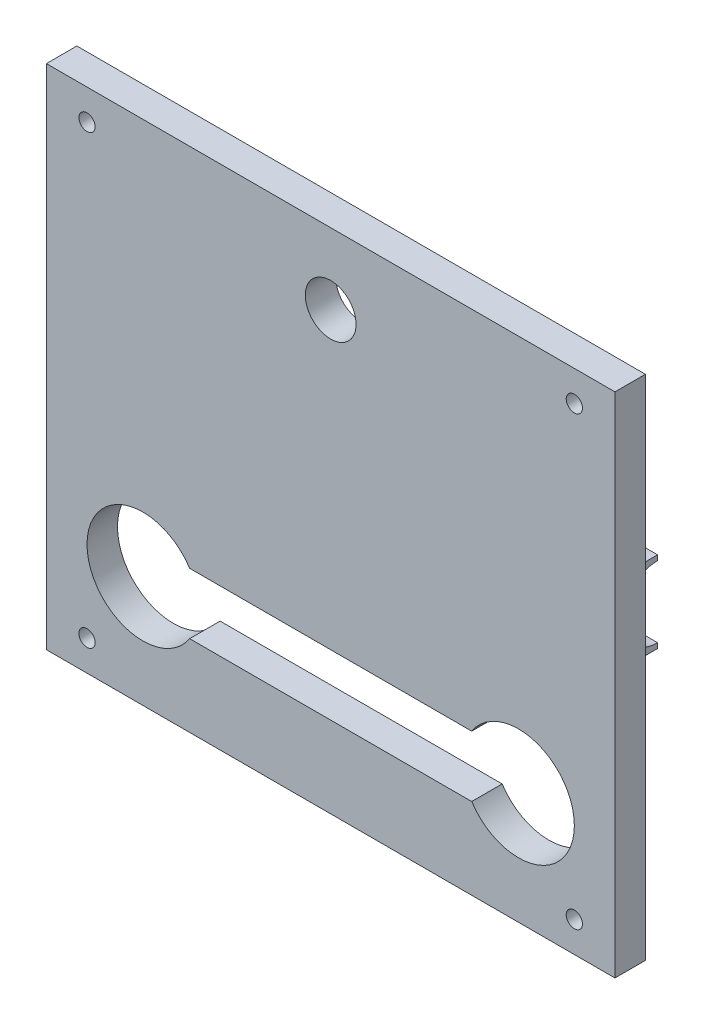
from build123d import *

# Parameters (mm, degrees)
ESQUISSE1_W             = 280
ESQUISSE1_H             = 250
BOSS_EXTRU_1_DEPTH      = 15
ENL_V_MAT_EXTRU_1_DEPTH = 15
BOSS_EXTRU_2_START      = -15
ESQUISSE3_W             = 230
ESQUISSE3_H             = 40
BOSS_EXTRU_2_DEPTH      = 46
ESQUISSE4_R             = 12.5
ENL_V_MAT_EXTRU_2_DEPTH = 15
ESQUISSE5_R             = 4
ENL_V_MAT_EXTRU_3_DEPTH = 15
ENL_V_MAT_EXTRU_4_DEPTH = 359.449438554


with BuildPart() as part:
    # Esquisse1 → Boss.-Extru.1 (new body)
    with BuildSketch(Plane.XY):
        with Locations((140, -125)):
            Rectangle(ESQUISSE1_W, ESQUISSE1_H)
    extrude(amount=BOSS_EXTRU_1_DEPTH)

    # Esquisse2 → Enl_v. mat.-Extru.1 (cut)
    with BuildSketch(Plane.XY.offset(15)):
        with BuildLine():
            Line((70.548861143, -180), (209.451138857, -180))
            ThreePointArc((209.451138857, -180), (260, -195), (209.451138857, -210))
            Line((209.451138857, -210), (70.548861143, -210))
            ThreePointArc((70.548861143, -210), (20, -195), (70.548861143, -180))
        make_face()
    extrude(amount=-ENL_V_MAT_EXTRU_1_DEPTH, mode=Mode.SUBTRACT)

    # Esquisse3 → Boss.-Extru.2 (add)
    with BuildSketch(Plane(origin=(0, 0, 0), x_dir=(-1, 0, 0), z_dir=(0, 0, -1)).offset(BOSS_EXTRU_2_START)):
        with Locations((-140, -125)):
            Rectangle(ESQUISSE3_W, ESQUISSE3_H)
    extrude(amount=BOSS_EXTRU_2_DEPTH)

    # Esquisse4 → Enl_v. mat.-Extru.2 (cut)
    with BuildSketch(Plane.XY.offset(15)):
        with Locations((140, -35)):
            Circle(ESQUISSE4_R)
    extrude(amount=-ENL_V_MAT_EXTRU_2_DEPTH, mode=Mode.SUBTRACT)

    # Esquisse5 → Enl_v. mat.-Extru.3 (cut)
    with BuildSketch(Plane.XY.offset(15)):
        with Locations((20, -235)):
            Circle(ESQUISSE5_R)
        with Locations((260, -235)):
            Circle(ESQUISSE5_R)
        with Locations((20, -15)):
            Circle(ESQUISSE5_R)
        with Locations((260, -15)):
            Circle(ESQUISSE5_R)
    extrude(amount=-ENL_V_MAT_EXTRU_3_DEPTH, mode=Mode.SUBTRACT)

    # Esquisse6 → Enl_v. mat.-Extru.4 (cut, through all)
    with BuildSketch(Plane(origin=(255, 0, 0), x_dir=(0, 0, -1), z_dir=(1, 0, 0))):
        with BuildLine():
            Line((31, -142.5), (31, -107.5))
            ThreePointArc((31, -107.5), (13.5, -125), (31, -142.5))
        make_face()
    extrude(amount=-ENL_V_MAT_EXTRU_4_DEPTH, mode=Mode.SUBTRACT)


solid = part.part
